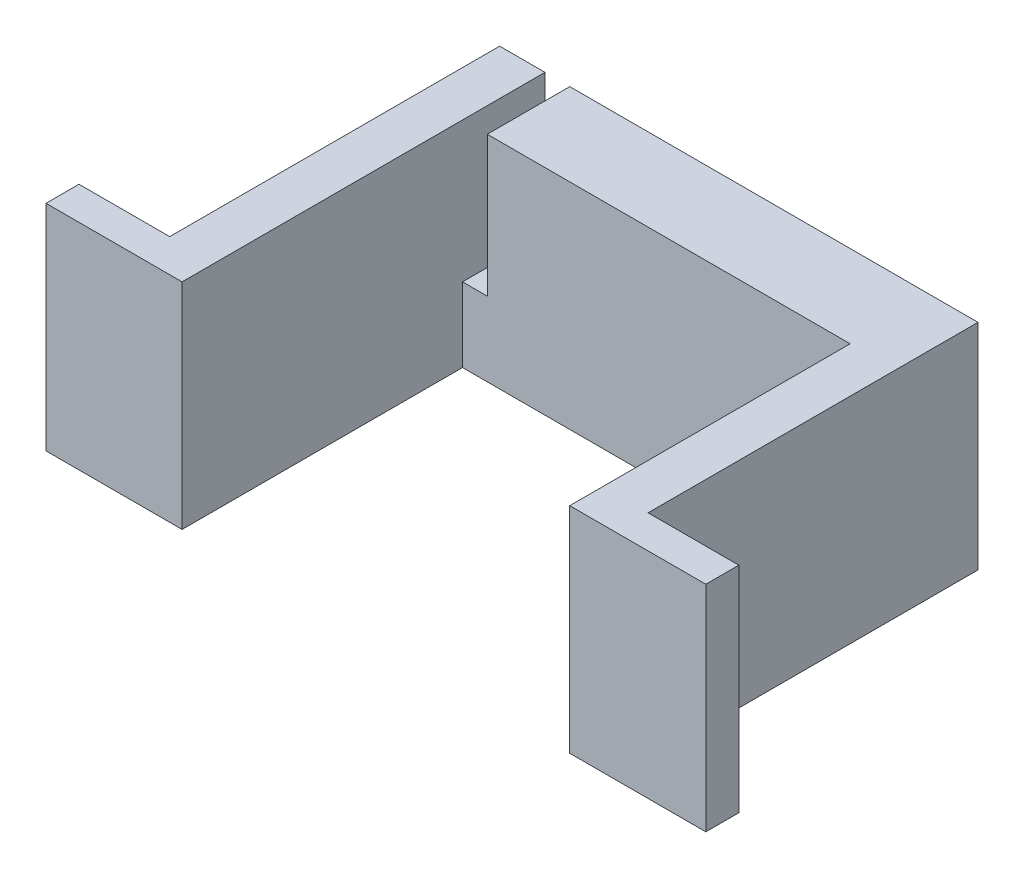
from build123d import *

# Parameters (mm, degrees)
SKETCH_1_W          = 29
SKETCH_1_H          = 22
EXTRUDE_1_DEPTH     = 13
SKETCH_2_W          = 2
SKETCH_2_H          = 13
EXTRUDE_2_DEPTH     = 5.5
SKETCH_3_W          = 2
SKETCH_3_H          = 13
EXTRUDE_3_DEPTH     = 5.5
SKETCH_4_W          = 23.5
SKETCH_4_H          = 17
CUT_EXTRUDE_1_DEPTH = 43.933087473
SKETCH_5_W          = 1.5
SKETCH_5_H          = 8.5
CUT_EXTRUDE_2_DEPTH = 41.598645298


with BuildPart() as part:
    # Sketch 1 → Extrude 1 (new body)
    with BuildSketch(Plane(origin=(0, 0, 0), x_dir=(1, 0, 0), z_dir=(0, 1, 0))):
        with Locations((14.5, 11)):
            Rectangle(SKETCH_1_W, SKETCH_1_H)
    extrude(amount=EXTRUDE_1_DEPTH)

    # Sketch 2 → Extrude 2 (add)
    with BuildSketch(Plane(origin=(29, 0, 0), x_dir=(0, 0, -1), z_dir=(1, 0, 0))):
        with Locations((1, 6.5)):
            Rectangle(SKETCH_2_W, SKETCH_2_H)
    extrude(amount=EXTRUDE_2_DEPTH)

    # Sketch 3 → Extrude 3 (add)
    with BuildSketch(Plane.ZY):
        with Locations((-1, 6.5)):
            Rectangle(SKETCH_3_W, SKETCH_3_H)
    extrude(amount=EXTRUDE_3_DEPTH)

    # Sketch 4 → Cut-Extrude 1 (cut, through all)
    with BuildSketch(Plane(origin=(0, 13, 0), x_dir=(1, 0, 0), z_dir=(0, 1, 0))):
        with Locations((14.5, 8.5)):
            Rectangle(SKETCH_4_W, SKETCH_4_H)
    extrude(amount=-CUT_EXTRUDE_1_DEPTH, mode=Mode.SUBTRACT)

    # Sketch 5 → Cut-Extrude 2 (cut, through all)
    with BuildSketch(Plane.XY.offset(-17)):
        with Locations((3.5, 8.75)):
            Rectangle(SKETCH_5_W, SKETCH_5_H)
    extrude(amount=-CUT_EXTRUDE_2_DEPTH, mode=Mode.SUBTRACT)


solid = part.part
